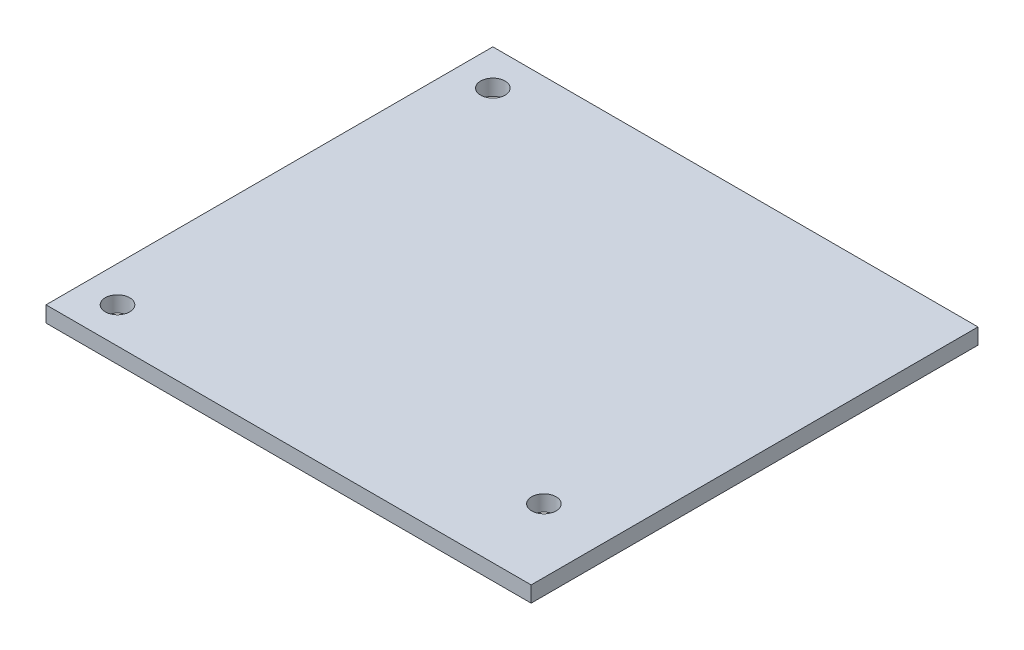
from build123d import *

# Parameters (mm, degrees)
SKETCH1_W           = 48.26
SKETCH1_H           = 44.45
SKETCH1_R           = 1.2192
BOSS_EXTRUDE1_DEPTH = 1.5748


with BuildPart() as part:
    # Sketch1 → Boss-Extrude1 (new body)
    with BuildSketch(Plane(origin=(0, 0, 0), x_dir=(1, 0, 0), z_dir=(0, 1, 0))):
        with Locations((24.13, 22.225)):
            Rectangle(SKETCH1_W, SKETCH1_H)
        with Locations(Location((3.556, 40.894, 0), (0, 0, 270))):
            Circle(SKETCH1_R, mode=Mode.SUBTRACT)
        with Locations(Location((3.556, 3.556, 0), (0, 0, 270))):
            Circle(SKETCH1_R, mode=Mode.SUBTRACT)
        with Locations(Location((41.91, 7.62, 0), (0, 0, 270))):
            Circle(SKETCH1_R, mode=Mode.SUBTRACT)
    extrude(amount=BOSS_EXTRUDE1_DEPTH)


solid = part.part
